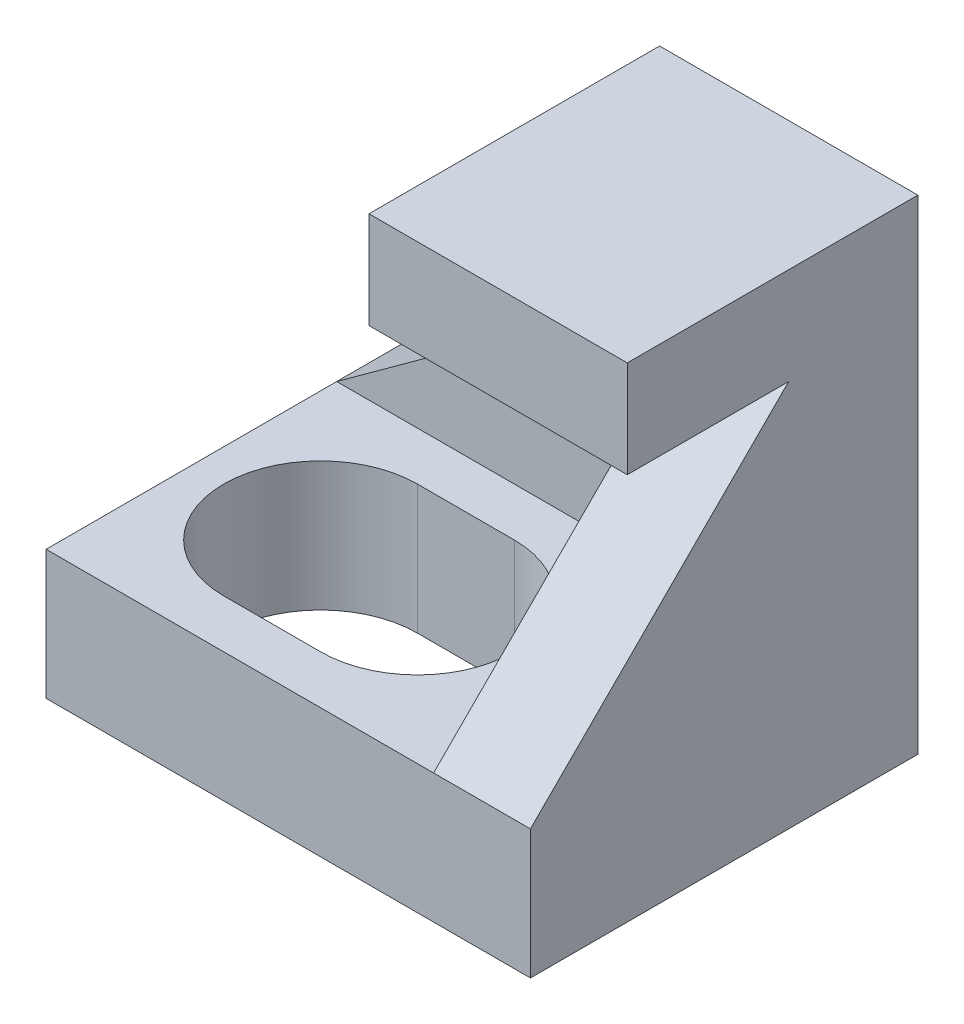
from build123d import *

# Parameters (mm, degrees)
SKETCH_1_W          = 75
SKETCH_1_H          = 60
EXTRUDE_1_DEPTH     = 20
EXTRUDE_2_DEPTH     = 15
EXTRUDE_3_DEPTH     = 15
SKETCH_4_W          = 40
SKETCH_4_H          = 45
EXTRUDE_4_DEPTH     = 15
CUT_EXTRUDE_1_DEPTH = 111.679718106


with BuildPart() as part:
    # Sketch 1 → Extrude 1 (new body)
    with BuildSketch(Plane(origin=(0, 0, 0), x_dir=(1, 0, 0), z_dir=(0, 1, 0))):
        with Locations((37.5, 30)):
            Rectangle(SKETCH_1_W, SKETCH_1_H)
    extrude(amount=EXTRUDE_1_DEPTH)

    # Sketch 2 → Extrude 2 (add)
    with BuildSketch(Plane(origin=(0, 0, -60), x_dir=(-1, 0, 0), z_dir=(0, 0, -1))):
        Polygon((0, 20), (-55, 60), (-75, 60), (-75, 20), align=None)
    extrude(amount=-EXTRUDE_2_DEPTH)

    # Sketch 3 → Extrude 3 (add)
    with BuildSketch(Plane(origin=(75, 0, 0), x_dir=(0, 0, -1), z_dir=(1, 0, 0))):
        Polygon((0, 20), (40, 60), (60, 60), (60, 20), align=None)
    extrude(amount=-EXTRUDE_3_DEPTH)

    # Sketch 4 → Extrude 4 (add)
    with BuildSketch(Plane(origin=(0, 60, 0), x_dir=(1, 0, 0), z_dir=(0, 1, 0))):
        with Locations((55, 37.5)):
            Rectangle(SKETCH_4_W, SKETCH_4_H)
    extrude(amount=EXTRUDE_4_DEPTH)

    # Sketch 5 → Cut-Extrude 1 (cut, through all)
    with BuildSketch(Plane(origin=(0, 20, 0), x_dir=(1, 0, 0), z_dir=(0, 1, 0))):
        with BuildLine():
            Line((20, 7.5), (35, 7.5))
            ThreePointArc((35, 7.5), (50, 22.5), (35, 37.5))
            Line((35, 37.5), (20, 37.5))
            ThreePointArc((20, 37.5), (5, 22.5), (20, 7.5))
        make_face()
    extrude(amount=-CUT_EXTRUDE_1_DEPTH, mode=Mode.SUBTRACT)


solid = part.part
